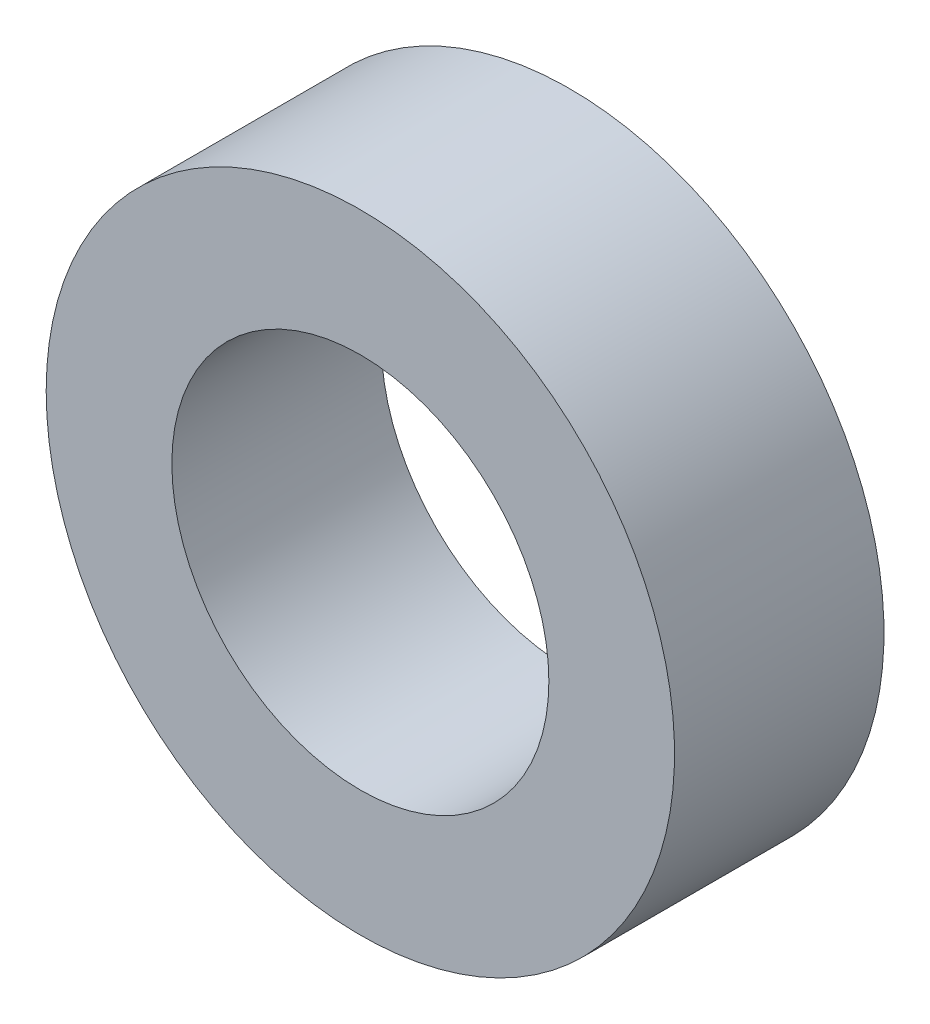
from build123d import *

# Parameters (mm, degrees)
LOGO3_BIB1_W = 3.81
LOGO3_BIB1_H = 6.35


with BuildPart() as part:
    # Logo3_bib1 → Revolve1 (revolve)
    with BuildSketch(Plane(origin=(0, 0, 0), x_dir=(-1, 0, 0), z_dir=(0, -1, 0))):
        with Locations((7.62, -3.175)):
            Rectangle(LOGO3_BIB1_W, LOGO3_BIB1_H)
    revolve(axis=Axis((0, 0, -38.976362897), (0, 0, 1)))


solid = part.part
